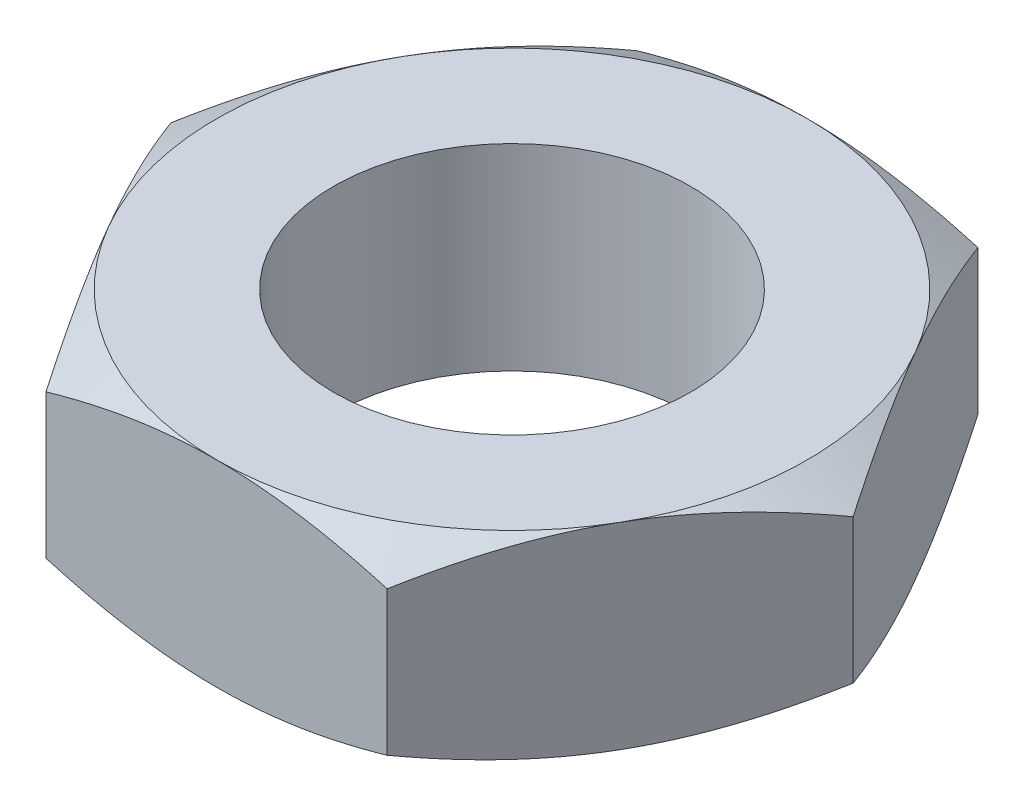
ISO-10303-21;
HEADER;
FILE_DESCRIPTION(('STEP AP214'),'2;1');
FILE_NAME('part.step','',(''),(''),'','','');
FILE_SCHEMA(('AUTOMOTIVE_DESIGN { 1 0 10303 214 1 1 1 1 }'));
ENDSEC;
DATA;
#1=APPLICATION_CONTEXT('core data for automotive mechanical design processes');
#2=APPLICATION_PROTOCOL_DEFINITION('international standard','automotive_design',2000,#1);
#3=PRODUCT_CONTEXT('',#1,'mechanical');
#4=PRODUCT('Part','Part','',(#3));
#5=PRODUCT_RELATED_PRODUCT_CATEGORY('part','',(#4));
#6=PRODUCT_DEFINITION_FORMATION('','',#4);
#7=PRODUCT_DEFINITION_CONTEXT('part definition',#1,'design');
#8=PRODUCT_DEFINITION('design','',#6,#7);
#9=PRODUCT_DEFINITION_SHAPE('','',#8);
#10=(LENGTH_UNIT() NAMED_UNIT(*) SI_UNIT(.MILLI.,.METRE.));
#11=(NAMED_UNIT(*) PLANE_ANGLE_UNIT() SI_UNIT($,.RADIAN.));
#12=(NAMED_UNIT(*) SI_UNIT($,.STERADIAN.) SOLID_ANGLE_UNIT());
#13=UNCERTAINTY_MEASURE_WITH_UNIT(LENGTH_MEASURE(1.E-05),#10,'distance_accuracy_value','');
#14=(GEOMETRIC_REPRESENTATION_CONTEXT(3) GLOBAL_UNCERTAINTY_ASSIGNED_CONTEXT((#13)) GLOBAL_UNIT_ASSIGNED_CONTEXT((#10,
#11,#12)) REPRESENTATION_CONTEXT('',''));
#15=CARTESIAN_POINT('',(0.,0.,0.));
#16=DIRECTION('',(0.,0.,1.));
#17=DIRECTION('',(1.,0.,0.));
#18=AXIS2_PLACEMENT_3D('',#15,#16,#17);
#19=CARTESIAN_POINT('',(-6.92820323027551,8.,12.));
#20=DIRECTION('',(0.,0.,-1.));
#21=DIRECTION('',(-1.,0.,0.));
#22=AXIS2_PLACEMENT_3D('',#19,#20,#21);
#23=PLANE('',#22);
#24=CARTESIAN_POINT('',(-18.6434122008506,5.8725365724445,12.));
#25=CARTESIAN_POINT('',(-18.3812273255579,5.74525423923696,12.));
#26=CARTESIAN_POINT('',(-18.1187356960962,5.61860407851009,12.));
#27=CARTESIAN_POINT('',(-17.5930749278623,5.36671120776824,12.));
#28=CARTESIAN_POINT('',(-17.329905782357,5.24146851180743,12.));
#29=CARTESIAN_POINT('',(-16.5392164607,4.86803349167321,12.));
#30=CARTESIAN_POINT('',(-16.0105914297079,4.62217173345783,12.));
#31=CARTESIAN_POINT('',(-14.9469541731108,4.13682677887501,12.));
#32=CARTESIAN_POINT('',(-14.4119228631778,3.89738530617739,12.));
#33=CARTESIAN_POINT('',(-13.3376171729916,3.42825229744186,12.));
#34=CARTESIAN_POINT('',(-12.7983429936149,3.19856030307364,12.));
#35=CARTESIAN_POINT('',(-11.6971343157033,2.74426091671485,12.));
#36=CARTESIAN_POINT('',(-11.1350315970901,2.52005916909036,12.));
#37=CARTESIAN_POINT('',(-10.0042582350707,2.08854249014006,12.));
#38=CARTESIAN_POINT('',(-9.43558686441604,1.88122944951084,12.));
#39=CARTESIAN_POINT('',(-8.29184369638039,1.48891137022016,12.));
#40=CARTESIAN_POINT('',(-7.71678741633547,1.30386145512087,12.));
#41=CARTESIAN_POINT('',(-6.55837133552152,0.961975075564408,12.));
#42=CARTESIAN_POINT('',(-5.9750142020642,0.805129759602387,12.));
#43=CARTESIAN_POINT('',(-5.09526966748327,0.597105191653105,12.));
#44=CARTESIAN_POINT('',(-4.80205079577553,0.532445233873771,12.));
#45=CARTESIAN_POINT('',(-4.21360328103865,0.412972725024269,12.));
#46=CARTESIAN_POINT('',(-3.91837467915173,0.358159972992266,12.));
#47=CARTESIAN_POINT('',(-3.32610862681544,0.259347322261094,12.));
#48=CARTESIAN_POINT('',(-3.02907120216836,0.215347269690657,12.));
#49=CARTESIAN_POINT('',(-2.43349976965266,0.139036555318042,12.));
#50=CARTESIAN_POINT('',(-2.13496582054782,0.10672543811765,12.));
#51=CARTESIAN_POINT('',(-1.54073050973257,0.0548414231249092,12.));
#52=CARTESIAN_POINT('',(-1.24504333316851,0.0351070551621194,12.));
#53=CARTESIAN_POINT('',(-0.653099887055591,0.00816211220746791,12.));
#54=CARTESIAN_POINT('',(-0.356843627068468,0.00095132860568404,12.));
#55=CARTESIAN_POINT('',(0.235708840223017,-0.000774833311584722,12.));
#56=CARTESIAN_POINT('',(0.532005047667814,0.00470983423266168,12.));
#57=CARTESIAN_POINT('',(1.12410170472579,0.0282404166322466,12.));
#58=CARTESIAN_POINT('',(1.41990213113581,0.046286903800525,12.));
#59=CARTESIAN_POINT('',(2.12980105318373,0.104287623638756,12.));
#60=CARTESIAN_POINT('',(2.54342568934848,0.15014631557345,12.));
#61=CARTESIAN_POINT('',(3.36762955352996,0.263936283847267,12.));
#62=CARTESIAN_POINT('',(3.7782083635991,0.331870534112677,12.));
#63=CARTESIAN_POINT('',(4.59592121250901,0.487395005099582,12.));
#64=CARTESIAN_POINT('',(5.00305232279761,0.575000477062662,12.));
#65=CARTESIAN_POINT('',(5.81324231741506,0.767192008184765,12.));
#66=CARTESIAN_POINT('',(6.21630126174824,0.871777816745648,12.));
#67=CARTESIAN_POINT('',(7.02721090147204,1.09785494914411,12.));
#68=CARTESIAN_POINT('',(7.43497120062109,1.21966827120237,12.));
#69=CARTESIAN_POINT('',(8.24647542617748,1.47594194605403,12.));
#70=CARTESIAN_POINT('',(8.65021932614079,1.61040238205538,12.));
#71=CARTESIAN_POINT('',(9.4538890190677,1.88983002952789,12.));
#72=CARTESIAN_POINT('',(9.85381602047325,2.03479378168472,12.));
#73=CARTESIAN_POINT('',(10.6503522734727,2.33351665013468,12.));
#74=CARTESIAN_POINT('',(11.0469615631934,2.48727566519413,12.));
#75=CARTESIAN_POINT('',(11.9796831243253,2.85888391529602,12.));
#76=CARTESIAN_POINT('',(12.514548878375,3.0798570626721,12.));
#77=CARTESIAN_POINT('',(13.5797439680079,3.53251041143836,12.));
#78=CARTESIAN_POINT('',(14.1100730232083,3.76419126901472,12.));
#79=CARTESIAN_POINT('',(15.1670347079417,4.2361253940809,12.));
#80=CARTESIAN_POINT('',(15.693666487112,4.47638056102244,12.));
#81=CARTESIAN_POINT('',(16.7437293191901,4.96374095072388,12.));
#82=CARTESIAN_POINT('',(17.2671604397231,5.21084602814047,12.));
#83=CARTESIAN_POINT('',(18.311920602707,5.7109032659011,12.));
#84=CARTESIAN_POINT('',(18.8332467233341,5.96386152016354,12.));
#85=CARTESIAN_POINT('',(19.8736465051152,6.47436761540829,12.));
#86=CARTESIAN_POINT('',(20.3927201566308,6.73191547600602,12.));
#87=CARTESIAN_POINT('',(21.4288931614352,7.25078329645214,12.));
#88=CARTESIAN_POINT('',(21.9459927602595,7.5121027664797,12.));
#89=CARTESIAN_POINT('',(22.9785686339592,8.03793120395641,12.));
#90=CARTESIAN_POINT('',(23.4940449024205,8.30244018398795,12.));
#91=CARTESIAN_POINT('',(24.9524027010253,9.05557837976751,12.));
#92=CARTESIAN_POINT('',(25.8936507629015,9.54737055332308,12.));
#93=CARTESIAN_POINT('',(27.7726304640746,10.5376909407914,12.));
#94=CARTESIAN_POINT('',(28.710361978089,11.0362193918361,12.));
#95=CARTESIAN_POINT('',(30.5807300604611,12.0371886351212,12.));
#96=CARTESIAN_POINT('',(31.513373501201,12.5396165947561,12.));
#97=CARTESIAN_POINT('',(32.9106782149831,13.2962602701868,12.));
#98=CARTESIAN_POINT('',(33.3761571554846,13.5489682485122,12.));
#99=CARTESIAN_POINT('',(34.3066240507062,14.0552848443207,12.));
#100=CARTESIAN_POINT('',(34.7716120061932,14.3088934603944,12.));
#101=CARTESIAN_POINT('',(35.236382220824,14.5629006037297,12.));
#102=B_SPLINE_CURVE_WITH_KNOTS('',3,(#24,#25,#26,#27,#28,#29,#30,#31,#32,#33,#34,#35,#36,#37,
#38,#39,#40,#41,#42,#43,#44,#45,#46,#47,#48,#49,#50,#51,#52,#53,#54,#55,#56,#57,#58,#59,#60,#61,
#62,#63,#64,#65,#66,#67,#68,#69,#70,#71,#72,#73,#74,#75,#76,#77,#78,#79,#80,#81,#82,#83,#84,#85,
#86,#87,#88,#89,#90,#91,#92,#93,#94,#95,#96,#97,#98,#99,#100,#101),.UNSPECIFIED.,.F.,.F.,(4,2,2,
2,2,2,2,2,2,2,2,2,2,2,2,2,2,2,2,2,2,2,2,2,2,2,2,2,2,2,2,2,2,2,2,2,2,2,4),(0.,0.874341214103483,
1.74869115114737,3.4976480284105,5.25607058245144,7.01441037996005,8.8297011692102,
10.6451949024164,12.4569654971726,14.2681665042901,15.1688186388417,16.0694523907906,
16.9700733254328,17.8706591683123,18.7594363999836,19.6481988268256,20.5369644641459,
21.4257705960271,22.6735580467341,23.9215136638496,25.170440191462,26.4193482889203,
27.6958030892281,28.9722662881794,30.2483109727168,31.524340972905,33.2603266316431,
34.9964188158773,36.7328980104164,38.4693403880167,40.2076801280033,41.9460272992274,
43.6841507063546,45.4222809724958,48.6081880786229,51.7942076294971,54.972294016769,
56.5612513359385,58.1502061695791),.UNSPECIFIED.);
#103=CARTESIAN_POINT('',(6.92820323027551,1.07179676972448,12.));
#104=VERTEX_POINT('',#103);
#105=CARTESIAN_POINT('',(0.,0.,12.));
#106=VERTEX_POINT('',#105);
#107=EDGE_CURVE('E127',#104,#106,#102,.F.);
#108=ORIENTED_EDGE('',*,*,#107,.F.);
#109=DIRECTION('',(0.,-1.,0.));
#110=VECTOR('',#109,1.);
#111=CARTESIAN_POINT('',(6.92820323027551,8.,12.));
#112=LINE('',#111,#110);
#113=CARTESIAN_POINT('',(6.92820323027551,6.92820323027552,12.));
#114=VERTEX_POINT('',#113);
#115=EDGE_CURVE('E261',#114,#104,#112,.T.);
#116=ORIENTED_EDGE('',*,*,#115,.F.);
#117=CARTESIAN_POINT('',(-18.6434122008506,2.1274634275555,12.));
#118=CARTESIAN_POINT('',(-18.3812273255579,2.25474576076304,12.));
#119=CARTESIAN_POINT('',(-18.1187356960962,2.38139592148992,12.));
#120=CARTESIAN_POINT('',(-17.5930749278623,2.63328879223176,12.));
#121=CARTESIAN_POINT('',(-17.329905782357,2.75853148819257,12.));
#122=CARTESIAN_POINT('',(-16.5392164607,3.13196650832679,12.));
#123=CARTESIAN_POINT('',(-16.0105914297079,3.37782826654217,12.));
#124=CARTESIAN_POINT('',(-14.9469541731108,3.86317322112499,12.));
#125=CARTESIAN_POINT('',(-14.4119228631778,4.10261469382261,12.));
#126=CARTESIAN_POINT('',(-13.3376171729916,4.57174770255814,12.));
#127=CARTESIAN_POINT('',(-12.7983429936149,4.80143969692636,12.));
#128=CARTESIAN_POINT('',(-11.6971343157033,5.25573908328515,12.));
#129=CARTESIAN_POINT('',(-11.1350315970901,5.47994083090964,12.));
#130=CARTESIAN_POINT('',(-10.0042582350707,5.91145750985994,12.));
#131=CARTESIAN_POINT('',(-9.43558686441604,6.11877055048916,12.));
#132=CARTESIAN_POINT('',(-8.29184369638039,6.51108862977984,12.));
#133=CARTESIAN_POINT('',(-7.71678741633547,6.69613854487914,12.));
#134=CARTESIAN_POINT('',(-6.55837133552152,7.03802492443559,12.));
#135=CARTESIAN_POINT('',(-5.9750142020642,7.19487024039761,12.));
#136=CARTESIAN_POINT('',(-5.09526966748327,7.4028948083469,12.));
#137=CARTESIAN_POINT('',(-4.80205079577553,7.46755476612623,12.));
#138=CARTESIAN_POINT('',(-4.21360328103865,7.58702727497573,12.));
#139=CARTESIAN_POINT('',(-3.91837467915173,7.64184002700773,12.));
#140=CARTESIAN_POINT('',(-3.32610862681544,7.74065267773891,12.));
#141=CARTESIAN_POINT('',(-3.02907120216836,7.78465273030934,12.));
#142=CARTESIAN_POINT('',(-2.43349976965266,7.86096344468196,12.));
#143=CARTESIAN_POINT('',(-2.13496582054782,7.89327456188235,12.));
#144=CARTESIAN_POINT('',(-1.54073050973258,7.94515857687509,12.));
#145=CARTESIAN_POINT('',(-1.24504333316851,7.96489294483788,12.));
#146=CARTESIAN_POINT('',(-0.653099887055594,7.99183788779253,12.));
#147=CARTESIAN_POINT('',(-0.356843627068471,7.99904867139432,12.));
#148=CARTESIAN_POINT('',(0.235708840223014,8.00077483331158,12.));
#149=CARTESIAN_POINT('',(0.532005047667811,7.99529016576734,12.));
#150=CARTESIAN_POINT('',(1.12410170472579,7.97175958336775,12.));
#151=CARTESIAN_POINT('',(1.41990213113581,7.95371309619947,12.));
#152=CARTESIAN_POINT('',(2.12980105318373,7.89571237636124,12.));
#153=CARTESIAN_POINT('',(2.54342568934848,7.84985368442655,12.));
#154=CARTESIAN_POINT('',(3.36762955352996,7.73606371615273,12.));
#155=CARTESIAN_POINT('',(3.7782083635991,7.66812946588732,12.));
#156=CARTESIAN_POINT('',(4.595921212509,7.51260499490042,12.));
#157=CARTESIAN_POINT('',(5.00305232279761,7.42499952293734,12.));
#158=CARTESIAN_POINT('',(5.81324231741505,7.23280799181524,12.));
#159=CARTESIAN_POINT('',(6.21630126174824,7.12822218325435,12.));
#160=CARTESIAN_POINT('',(7.02721090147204,6.90214505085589,12.));
#161=CARTESIAN_POINT('',(7.43497120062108,6.78033172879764,12.));
#162=CARTESIAN_POINT('',(8.24647542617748,6.52405805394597,12.));
#163=CARTESIAN_POINT('',(8.65021932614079,6.38959761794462,12.));
#164=CARTESIAN_POINT('',(9.45388901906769,6.11016997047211,12.));
#165=CARTESIAN_POINT('',(9.85381602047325,5.96520621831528,12.));
#166=CARTESIAN_POINT('',(10.6503522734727,5.66648334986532,12.));
#167=CARTESIAN_POINT('',(11.0469615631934,5.51272433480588,12.));
#168=CARTESIAN_POINT('',(11.9796831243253,5.14111608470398,12.));
#169=CARTESIAN_POINT('',(12.514548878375,4.92014293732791,12.));
#170=CARTESIAN_POINT('',(13.5797439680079,4.46748958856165,12.));
#171=CARTESIAN_POINT('',(14.1100730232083,4.23580873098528,12.));
#172=CARTESIAN_POINT('',(15.1670347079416,3.7638746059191,12.));
#173=CARTESIAN_POINT('',(15.693666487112,3.52361943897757,12.));
#174=CARTESIAN_POINT('',(16.7437293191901,3.03625904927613,12.));
#175=CARTESIAN_POINT('',(17.2671604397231,2.78915397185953,12.));
#176=CARTESIAN_POINT('',(18.311920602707,2.2890967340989,12.));
#177=CARTESIAN_POINT('',(18.833246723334,2.03613847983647,12.));
#178=CARTESIAN_POINT('',(19.8736465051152,1.52563238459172,12.));
#179=CARTESIAN_POINT('',(20.3927201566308,1.26808452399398,12.));
#180=CARTESIAN_POINT('',(21.4288931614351,0.749216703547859,12.));
#181=CARTESIAN_POINT('',(21.9459927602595,0.487897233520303,12.));
#182=CARTESIAN_POINT('',(22.9785686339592,-0.0379312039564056,12.));
#183=CARTESIAN_POINT('',(23.4940449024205,-0.302440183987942,12.));
#184=CARTESIAN_POINT('',(24.9524027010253,-1.05557837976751,12.));
#185=CARTESIAN_POINT('',(25.8936507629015,-1.54737055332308,12.));
#186=CARTESIAN_POINT('',(27.7726304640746,-2.53769094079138,12.));
#187=CARTESIAN_POINT('',(28.710361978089,-3.03621939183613,12.));
#188=CARTESIAN_POINT('',(30.5807300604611,-4.03718863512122,12.));
#189=CARTESIAN_POINT('',(31.513373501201,-4.53961659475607,12.));
#190=CARTESIAN_POINT('',(32.9106782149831,-5.29626027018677,12.));
#191=CARTESIAN_POINT('',(33.3761571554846,-5.54896824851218,12.));
#192=CARTESIAN_POINT('',(34.3066240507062,-6.0552848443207,12.));
#193=CARTESIAN_POINT('',(34.7716120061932,-6.30889346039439,12.));
#194=CARTESIAN_POINT('',(35.236382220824,-6.56290060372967,12.));
#195=B_SPLINE_CURVE_WITH_KNOTS('',3,(#117,#118,#119,#120,#121,#122,#123,#124,#125,#126,#127,
#128,#129,#130,#131,#132,#133,#134,#135,#136,#137,#138,#139,#140,#141,#142,#143,#144,#145,#146,
#147,#148,#149,#150,#151,#152,#153,#154,#155,#156,#157,#158,#159,#160,#161,#162,#163,#164,#165,
#166,#167,#168,#169,#170,#171,#172,#173,#174,#175,#176,#177,#178,#179,#180,#181,#182,#183,#184,
#185,#186,#187,#188,#189,#190,#191,#192,#193,#194),.UNSPECIFIED.,.F.,.F.,(4,2,2,2,2,2,2,2,2,2,2,
2,2,2,2,2,2,2,2,2,2,2,2,2,2,2,2,2,2,2,2,2,2,2,2,2,2,2,4),(0.,0.874341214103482,1.74869115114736,
3.4976480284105,5.25607058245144,7.01441037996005,8.8297011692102,10.6451949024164,
12.4569654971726,14.2681665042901,15.1688186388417,16.0694523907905,16.9700733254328,
17.8706591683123,18.7594363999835,19.6481988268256,20.5369644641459,21.425770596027,
22.6735580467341,23.9215136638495,25.170440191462,26.4193482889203,27.6958030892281,
28.9722662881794,30.2483109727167,31.524340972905,33.2603266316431,34.9964188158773,
36.7328980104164,38.4693403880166,40.2076801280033,41.9460272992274,43.6841507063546,
45.4222809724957,48.6081880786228,51.7942076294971,54.972294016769,56.5612513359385,
58.1502061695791),.UNSPECIFIED.);
#196=CARTESIAN_POINT('',(0.,8.,12.));
#197=VERTEX_POINT('',#196);
#198=EDGE_CURVE('E237',#197,#114,#195,.T.);
#199=ORIENTED_EDGE('',*,*,#198,.F.);
#200=CARTESIAN_POINT('',(-6.92820323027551,6.92820323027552,12.));
#201=VERTEX_POINT('',#200);
#202=EDGE_CURVE('E243',#201,#197,#195,.T.);
#203=ORIENTED_EDGE('',*,*,#202,.F.);
#204=DIRECTION('',(0.,-1.,0.));
#205=VECTOR('',#204,1.);
#206=CARTESIAN_POINT('',(-6.92820323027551,8.,12.));
#207=LINE('',#206,#205);
#208=CARTESIAN_POINT('',(-6.92820323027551,1.07179676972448,12.));
#209=VERTEX_POINT('',#208);
#210=EDGE_CURVE('E158',#201,#209,#207,.T.);
#211=ORIENTED_EDGE('',*,*,#210,.T.);
#212=EDGE_CURVE('E140',#106,#209,#102,.F.);
#213=ORIENTED_EDGE('',*,*,#212,.F.);
#214=EDGE_LOOP('',(#108,#116,#199,#203,#211,#213));
#215=FACE_BOUND('',#214,.T.);
#216=ADVANCED_FACE('F37',(#215),#23,.F.);
#217=CARTESIAN_POINT('',(6.92820323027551,8.,12.));
#218=DIRECTION('',(-0.866025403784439,0.,-0.5));
#219=DIRECTION('',(-0.5,0.,0.866025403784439));
#220=AXIS2_PLACEMENT_3D('',#217,#218,#219);
#221=PLANE('',#220);
#222=CARTESIAN_POINT('',(13.8565219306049,1.07186343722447,-0.000200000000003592));
#223=CARTESIAN_POINT('',(13.7042251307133,0.983949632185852,0.263585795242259));
#224=CARTESIAN_POINT('',(13.5513604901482,0.900025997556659,0.528355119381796));
#225=CARTESIAN_POINT('',(13.244405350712,0.741266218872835,1.06001701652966));
#226=CARTESIAN_POINT('',(13.0903144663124,0.666433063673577,1.32691025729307));
#227=CARTESIAN_POINT('',(12.6255589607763,0.457017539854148,2.13189040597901));
#228=CARTESIAN_POINT('',(12.3130596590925,0.337903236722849,2.6731550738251));
#229=CARTESIAN_POINT('',(11.8454187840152,0.198231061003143,3.48313282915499));
#230=CARTESIAN_POINT('',(11.6916742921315,0.158443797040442,3.74942610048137));
#231=CARTESIAN_POINT('',(11.3834734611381,0.091723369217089,4.28324559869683));
#232=CARTESIAN_POINT('',(11.2290171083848,0.0647904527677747,4.55077184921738));
#233=CARTESIAN_POINT('',(10.9198468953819,0.0244685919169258,5.08627036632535));
#234=CARTESIAN_POINT('',(10.7651335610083,0.0110635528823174,5.35424172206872));
#235=CARTESIAN_POINT('',(10.4555635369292,-0.00191690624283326,5.89043273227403));
#236=CARTESIAN_POINT('',(10.3007068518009,-0.00149275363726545,6.15865237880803));
#237=CARTESIAN_POINT('',(10.0112020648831,0.0122200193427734,6.6600893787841));
#238=CARTESIAN_POINT('',(9.87653331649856,0.0238359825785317,6.89334249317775));
#239=CARTESIAN_POINT('',(9.60750555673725,0.0573080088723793,7.35931224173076));
#240=CARTESIAN_POINT('',(9.47314656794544,0.0791647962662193,7.59202883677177));
#241=CARTESIAN_POINT('',(9.2048113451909,0.132737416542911,8.05679907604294));
#242=CARTESIAN_POINT('',(9.07083551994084,0.164461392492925,8.288852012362));
#243=CARTESIAN_POINT('',(8.80351197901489,0.237211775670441,8.75186996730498));
#244=CARTESIAN_POINT('',(8.67016430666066,0.278238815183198,8.98283491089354));
#245=CARTESIAN_POINT('',(8.2653799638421,0.416311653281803,9.68394195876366));
#246=CARTESIAN_POINT('',(7.99511549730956,0.527124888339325,10.1520537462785));
#247=CARTESIAN_POINT('',(7.45861659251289,0.77862576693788,11.0812971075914));
#248=CARTESIAN_POINT('',(7.19237528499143,0.919254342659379,11.5424405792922));
#249=CARTESIAN_POINT('',(6.92808776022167,1.07186343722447,12.0002));
#250=B_SPLINE_CURVE_WITH_KNOTS('',3,(#222,#223,#224,#225,#226,#227,#228,#229,#230,#231,#232,
#233,#234,#235,#236,#237,#238,#239,#240,#241,#242,#243,#244,#245,#246,#247,#248,#249),
.UNSPECIFIED.,.F.,.F.,(4,2,2,2,2,2,2,2,2,2,2,2,2,4),(0.,0.951004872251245,1.90232158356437,
3.80900466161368,4.7389455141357,5.66890426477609,6.59775529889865,7.5265776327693,
8.33514643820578,9.14377244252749,9.95306755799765,10.7624176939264,12.4167102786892,
14.0677556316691),.UNSPECIFIED.);
#251=CARTESIAN_POINT('',(13.856406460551,1.07179676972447,0.));
#252=VERTEX_POINT('',#251);
#253=CARTESIAN_POINT('',(10.3923048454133,0.,5.99999999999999));
#254=VERTEX_POINT('',#253);
#255=EDGE_CURVE('E54',#252,#254,#250,.T.);
#256=ORIENTED_EDGE('',*,*,#255,.F.);
#257=DIRECTION('',(0.,-1.,0.));
#258=VECTOR('',#257,1.);
#259=CARTESIAN_POINT('',(13.856406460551,8.,0.));
#260=LINE('',#259,#258);
#261=CARTESIAN_POINT('',(13.856406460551,6.92820323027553,0.));
#262=VERTEX_POINT('',#261);
#263=EDGE_CURVE('E257',#262,#252,#260,.T.);
#264=ORIENTED_EDGE('',*,*,#263,.F.);
#265=CARTESIAN_POINT('',(6.92808776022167,6.92813656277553,12.0002));
#266=CARTESIAN_POINT('',(7.08038456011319,7.01605036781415,11.7364142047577));
#267=CARTESIAN_POINT('',(7.23324920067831,7.09997400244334,11.4716448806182));
#268=CARTESIAN_POINT('',(7.54020434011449,7.25873378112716,10.9399829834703));
#269=CARTESIAN_POINT('',(7.69429522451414,7.33356693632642,10.6730897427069));
#270=CARTESIAN_POINT('',(8.15905073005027,7.54298246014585,9.86810959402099));
#271=CARTESIAN_POINT('',(8.47155003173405,7.66209676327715,9.3268449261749));
#272=CARTESIAN_POINT('',(8.93919090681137,7.80176893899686,8.516867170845));
#273=CARTESIAN_POINT('',(9.09293539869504,7.84155620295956,8.25057389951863));
#274=CARTESIAN_POINT('',(9.40113622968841,7.90827663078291,7.71675440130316));
#275=CARTESIAN_POINT('',(9.55559258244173,7.93520954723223,7.44922815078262));
#276=CARTESIAN_POINT('',(9.86476279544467,7.97553140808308,6.91372963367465));
#277=CARTESIAN_POINT('',(10.0194761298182,7.98893644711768,6.64575827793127));
#278=CARTESIAN_POINT('',(10.3290461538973,8.00191690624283,6.10956726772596));
#279=CARTESIAN_POINT('',(10.4839028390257,8.00149275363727,5.84134762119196));
#280=CARTESIAN_POINT('',(10.7734076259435,7.98777998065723,5.33991062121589));
#281=CARTESIAN_POINT('',(10.908076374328,7.97616401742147,5.10665750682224));
#282=CARTESIAN_POINT('',(11.1771041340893,7.94269199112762,4.64068775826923));
#283=CARTESIAN_POINT('',(11.3114631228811,7.92083520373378,4.40797116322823));
#284=CARTESIAN_POINT('',(11.5797983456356,7.86726258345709,3.94320092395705));
#285=CARTESIAN_POINT('',(11.7137741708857,7.83553860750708,3.71114798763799));
#286=CARTESIAN_POINT('',(11.9810977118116,7.76278822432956,3.24813003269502));
#287=CARTESIAN_POINT('',(12.1144453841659,7.7217611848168,3.01716508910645));
#288=CARTESIAN_POINT('',(12.5192297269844,7.5836883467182,2.31605804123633));
#289=CARTESIAN_POINT('',(12.789494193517,7.47287511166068,1.84794625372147));
#290=CARTESIAN_POINT('',(13.3259930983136,7.22137423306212,0.918702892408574));
#291=CARTESIAN_POINT('',(13.5922344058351,7.08074565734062,0.457559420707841));
#292=CARTESIAN_POINT('',(13.8565219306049,6.92813656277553,-0.00020000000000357));
#293=B_SPLINE_CURVE_WITH_KNOTS('',3,(#265,#266,#267,#268,#269,#270,#271,#272,#273,#274,#275,
#276,#277,#278,#279,#280,#281,#282,#283,#284,#285,#286,#287,#288,#289,#290,#291,#292),
.UNSPECIFIED.,.F.,.F.,(4,2,2,2,2,2,2,2,2,2,2,2,2,4),(0.,0.951004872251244,1.90232158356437,
3.80900466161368,4.7389455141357,5.66890426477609,6.59775529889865,7.5265776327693,
8.33514643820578,9.14377244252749,9.95306755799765,10.7624176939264,12.4167102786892,
14.0677556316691),.UNSPECIFIED.);
#294=CARTESIAN_POINT('',(10.3923048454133,8.,5.99999999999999));
#295=VERTEX_POINT('',#294);
#296=EDGE_CURVE('E223',#295,#262,#293,.T.);
#297=ORIENTED_EDGE('',*,*,#296,.F.);
#298=EDGE_CURVE('E230',#114,#295,#293,.T.);
#299=ORIENTED_EDGE('',*,*,#298,.F.);
#300=ORIENTED_EDGE('',*,*,#115,.T.);
#301=EDGE_CURVE('E133',#254,#104,#250,.T.);
#302=ORIENTED_EDGE('',*,*,#301,.F.);
#303=EDGE_LOOP('',(#256,#264,#297,#299,#300,#302));
#304=FACE_BOUND('',#303,.T.);
#305=ADVANCED_FACE('F215',(#304),#221,.F.);
#306=CARTESIAN_POINT('',(13.856406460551,8.,0.));
#307=DIRECTION('',(-0.866025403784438,0.,0.5));
#308=DIRECTION('',(0.5,0.,0.866025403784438));
#309=AXIS2_PLACEMENT_3D('',#306,#307,#308);
#310=PLANE('',#309);
#311=CARTESIAN_POINT('',(6.92808776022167,1.07186343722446,-12.0002));
#312=CARTESIAN_POINT('',(7.08038456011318,0.98394963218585,-11.7364142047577));
#313=CARTESIAN_POINT('',(7.2332492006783,0.900025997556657,-11.4716448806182));
#314=CARTESIAN_POINT('',(7.54020434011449,0.741266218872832,-10.9399829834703));
#315=CARTESIAN_POINT('',(7.69429522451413,0.666433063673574,-10.6730897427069));
#316=CARTESIAN_POINT('',(8.15905073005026,0.457017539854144,-9.86810959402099));
#317=CARTESIAN_POINT('',(8.47155003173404,0.337903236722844,-9.32684492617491));
#318=CARTESIAN_POINT('',(8.93919090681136,0.19823106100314,-8.51686717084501));
#319=CARTESIAN_POINT('',(9.09293539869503,0.158443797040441,-8.25057389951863));
#320=CARTESIAN_POINT('',(9.4011362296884,0.0917233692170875,-7.71675440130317));
#321=CARTESIAN_POINT('',(9.55559258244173,0.064790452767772,-7.44922815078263));
#322=CARTESIAN_POINT('',(9.86476279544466,0.0244685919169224,-6.91372963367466));
#323=CARTESIAN_POINT('',(10.0194761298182,0.0110635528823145,-6.64575827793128));
#324=CARTESIAN_POINT('',(10.3290461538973,-0.00191690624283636,-6.10956726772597));
#325=CARTESIAN_POINT('',(10.4839028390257,-0.00149275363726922,-5.84134762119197));
#326=CARTESIAN_POINT('',(10.7734076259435,0.0122200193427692,-5.33991062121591));
#327=CARTESIAN_POINT('',(10.908076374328,0.0238359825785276,-5.10665750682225));
#328=CARTESIAN_POINT('',(11.1771041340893,0.0573080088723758,-4.64068775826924));
#329=CARTESIAN_POINT('',(11.3114631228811,0.0791647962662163,-4.40797116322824));
#330=CARTESIAN_POINT('',(11.5797983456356,0.132737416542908,-3.94320092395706));
#331=CARTESIAN_POINT('',(11.7137741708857,0.164461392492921,-3.711147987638));
#332=CARTESIAN_POINT('',(11.9810977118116,0.237211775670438,-3.24813003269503));
#333=CARTESIAN_POINT('',(12.1144453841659,0.278238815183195,-3.01716508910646));
#334=CARTESIAN_POINT('',(12.5192297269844,0.416311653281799,-2.31605804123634));
#335=CARTESIAN_POINT('',(12.789494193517,0.527124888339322,-1.84794625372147));
#336=CARTESIAN_POINT('',(13.3259930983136,0.778625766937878,-0.91870289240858));
#337=CARTESIAN_POINT('',(13.5922344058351,0.919254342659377,-0.457559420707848));
#338=CARTESIAN_POINT('',(13.8565219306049,1.07186343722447,0.000199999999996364));
#339=B_SPLINE_CURVE_WITH_KNOTS('',3,(#311,#312,#313,#314,#315,#316,#317,#318,#319,#320,#321,
#322,#323,#324,#325,#326,#327,#328,#329,#330,#331,#332,#333,#334,#335,#336,#337,#338),
.UNSPECIFIED.,.F.,.F.,(4,2,2,2,2,2,2,2,2,2,2,2,2,4),(0.,0.951004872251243,1.90232158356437,
3.80900466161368,4.73894551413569,5.66890426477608,6.59775529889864,7.52657763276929,
8.33514643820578,9.14377244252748,9.95306755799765,10.7624176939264,12.4167102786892,
14.0677556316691),.UNSPECIFIED.);
#340=CARTESIAN_POINT('',(6.9282032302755,1.07179676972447,-12.));
#341=VERTEX_POINT('',#340);
#342=CARTESIAN_POINT('',(10.3923048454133,0.,-6.00000000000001));
#343=VERTEX_POINT('',#342);
#344=EDGE_CURVE('E61',#341,#343,#339,.T.);
#345=ORIENTED_EDGE('',*,*,#344,.F.);
#346=DIRECTION('',(0.,-1.,0.));
#347=VECTOR('',#346,1.);
#348=CARTESIAN_POINT('',(6.9282032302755,8.,-12.));
#349=LINE('',#348,#347);
#350=CARTESIAN_POINT('',(6.9282032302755,6.92820323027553,-12.));
#351=VERTEX_POINT('',#350);
#352=EDGE_CURVE('E253',#351,#341,#349,.T.);
#353=ORIENTED_EDGE('',*,*,#352,.F.);
#354=CARTESIAN_POINT('',(13.8565219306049,6.92813656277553,0.000199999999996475));
#355=CARTESIAN_POINT('',(13.7042251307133,7.01605036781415,-0.263585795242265));
#356=CARTESIAN_POINT('',(13.5513604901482,7.09997400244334,-0.528355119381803));
#357=CARTESIAN_POINT('',(13.244405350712,7.25873378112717,-1.06001701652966));
#358=CARTESIAN_POINT('',(13.0903144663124,7.33356693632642,-1.32691025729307));
#359=CARTESIAN_POINT('',(12.6255589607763,7.54298246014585,-2.13189040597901));
#360=CARTESIAN_POINT('',(12.3130596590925,7.66209676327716,-2.6731550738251));
#361=CARTESIAN_POINT('',(11.8454187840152,7.80176893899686,-3.483132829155));
#362=CARTESIAN_POINT('',(11.6916742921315,7.84155620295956,-3.74942610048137));
#363=CARTESIAN_POINT('',(11.3834734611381,7.90827663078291,-4.28324559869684));
#364=CARTESIAN_POINT('',(11.2290171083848,7.93520954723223,-4.55077184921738));
#365=CARTESIAN_POINT('',(10.9198468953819,7.97553140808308,-5.08627036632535));
#366=CARTESIAN_POINT('',(10.7651335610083,7.98893644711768,-5.35424172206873));
#367=CARTESIAN_POINT('',(10.4555635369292,8.00191690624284,-5.89043273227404));
#368=CARTESIAN_POINT('',(10.3007068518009,8.00149275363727,-6.15865237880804));
#369=CARTESIAN_POINT('',(10.011202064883,7.98777998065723,-6.6600893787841));
#370=CARTESIAN_POINT('',(9.87653331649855,7.97616401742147,-6.89334249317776));
#371=CARTESIAN_POINT('',(9.60750555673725,7.94269199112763,-7.35931224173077));
#372=CARTESIAN_POINT('',(9.47314656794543,7.92083520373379,-7.59202883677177));
#373=CARTESIAN_POINT('',(9.20481134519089,7.86726258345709,-8.05679907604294));
#374=CARTESIAN_POINT('',(9.07083551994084,7.83553860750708,-8.288852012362));
#375=CARTESIAN_POINT('',(8.80351197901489,7.76278822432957,-8.75186996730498));
#376=CARTESIAN_POINT('',(8.67016430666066,7.72176118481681,-8.98283491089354));
#377=CARTESIAN_POINT('',(8.2653799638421,7.5836883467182,-9.68394195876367));
#378=CARTESIAN_POINT('',(7.99511549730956,7.47287511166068,-10.1520537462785));
#379=CARTESIAN_POINT('',(7.45861659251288,7.22137423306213,-11.0812971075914));
#380=CARTESIAN_POINT('',(7.19237528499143,7.08074565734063,-11.5424405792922));
#381=CARTESIAN_POINT('',(6.92808776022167,6.92813656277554,-12.0002));
#382=B_SPLINE_CURVE_WITH_KNOTS('',3,(#354,#355,#356,#357,#358,#359,#360,#361,#362,#363,#364,
#365,#366,#367,#368,#369,#370,#371,#372,#373,#374,#375,#376,#377,#378,#379,#380,#381),
.UNSPECIFIED.,.F.,.F.,(4,2,2,2,2,2,2,2,2,2,2,2,2,4),(0.,0.951004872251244,1.90232158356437,
3.80900466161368,4.7389455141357,5.66890426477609,6.59775529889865,7.52657763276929,
8.33514643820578,9.14377244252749,9.95306755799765,10.7624176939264,12.4167102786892,
14.0677556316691),.UNSPECIFIED.);
#383=CARTESIAN_POINT('',(10.3923048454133,8.,-6.00000000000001));
#384=VERTEX_POINT('',#383);
#385=EDGE_CURVE('E232',#384,#351,#382,.T.);
#386=ORIENTED_EDGE('',*,*,#385,.F.);
#387=EDGE_CURVE('E231',#262,#384,#382,.T.);
#388=ORIENTED_EDGE('',*,*,#387,.F.);
#389=ORIENTED_EDGE('',*,*,#263,.T.);
#390=EDGE_CURVE('E209',#343,#252,#339,.T.);
#391=ORIENTED_EDGE('',*,*,#390,.F.);
#392=EDGE_LOOP('',(#345,#353,#386,#388,#389,#391));
#393=FACE_BOUND('',#392,.T.);
#394=ADVANCED_FACE('F218',(#393),#310,.F.);
#395=CARTESIAN_POINT('',(6.9282032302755,8.,-12.));
#396=DIRECTION('',(0.,0.,1.));
#397=DIRECTION('',(1.,0.,0.));
#398=AXIS2_PLACEMENT_3D('',#395,#396,#397);
#399=PLANE('',#398);
#400=CARTESIAN_POINT('',(-18.6434122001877,5.87253657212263,-12.));
#401=CARTESIAN_POINT('',(-18.3812273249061,5.74525423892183,-12.));
#402=CARTESIAN_POINT('',(-18.1187356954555,5.61860407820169,-12.));
#403=CARTESIAN_POINT('',(-17.5930749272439,5.36671120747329,-12.));
#404=CARTESIAN_POINT('',(-17.3299057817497,5.24146851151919,-12.));
#405=CARTESIAN_POINT('',(-16.5392164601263,4.8680334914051,-12.));
#406=CARTESIAN_POINT('',(-16.0105914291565,4.62217173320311,-12.));
#407=CARTESIAN_POINT('',(-14.9469541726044,4.13682677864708,-12.));
#408=CARTESIAN_POINT('',(-14.4119228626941,3.89738530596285,-12.));
#409=CARTESIAN_POINT('',(-13.3376171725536,3.4282522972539,-12.));
#410=CARTESIAN_POINT('',(-12.7983429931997,3.19856030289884,-12.));
#411=CARTESIAN_POINT('',(-11.6971343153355,2.74426091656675,-12.));
#412=CARTESIAN_POINT('',(-11.1350315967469,2.52005916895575,-12.));
#413=CARTESIAN_POINT('',(-10.0042582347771,2.08854249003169,-12.));
#414=CARTESIAN_POINT('',(-9.43558686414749,1.88122944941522,-12.));
#415=CARTESIAN_POINT('',(-8.2918436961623,1.48891137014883,-12.));
#416=CARTESIAN_POINT('',(-7.71678741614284,1.30386145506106,-12.));
#417=CARTESIAN_POINT('',(-6.55837133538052,0.961975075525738,-12.));
#418=CARTESIAN_POINT('',(-5.97501420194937,0.805129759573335,-12.));
#419=CARTESIAN_POINT('',(-5.09526966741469,0.597105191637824,-12.));
#420=CARTESIAN_POINT('',(-4.80205079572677,0.532445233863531,-12.));
#421=CARTESIAN_POINT('',(-4.21360328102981,0.412972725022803,-12.));
#422=CARTESIAN_POINT('',(-3.918374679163,0.358159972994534,-12.));
#423=CARTESIAN_POINT('',(-3.32610862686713,0.259347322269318,-12.));
#424=CARTESIAN_POINT('',(-3.02907120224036,0.215347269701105,-12.));
#425=CARTESIAN_POINT('',(-2.43349976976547,0.139036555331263,-12.));
#426=CARTESIAN_POINT('',(-2.13496582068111,0.106725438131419,-12.));
#427=CARTESIAN_POINT('',(-1.54073050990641,0.0548414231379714,-12.));
#428=CARTESIAN_POINT('',(-1.2450433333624,0.035107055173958,-12.));
#429=CARTESIAN_POINT('',(-0.65309988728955,0.00816211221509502,-12.));
#430=CARTESIAN_POINT('',(-0.356843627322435,0.000951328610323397,-12.));
#431=CARTESIAN_POINT('',(0.235708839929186,-0.000774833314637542,-12.));
#432=CARTESIAN_POINT('',(0.532005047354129,0.00470983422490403,-12.));
#433=CARTESIAN_POINT('',(1.12410170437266,0.0282404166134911,-12.));
#434=CARTESIAN_POINT('',(1.41990213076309,0.0462869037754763,-12.));
#435=CARTESIAN_POINT('',(2.12980105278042,0.104287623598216,-12.));
#436=CARTESIAN_POINT('',(2.54342568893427,0.150146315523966,-12.));
#437=CARTESIAN_POINT('',(3.36762955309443,0.263936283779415,-12.));
#438=CARTESIAN_POINT('',(3.77820836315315,0.331870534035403,-12.));
#439=CARTESIAN_POINT('',(4.59592121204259,0.487395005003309,-12.));
#440=CARTESIAN_POINT('',(5.00305232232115,0.575000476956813,-12.));
#441=CARTESIAN_POINT('',(5.81324231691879,0.767192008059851,-12.));
#442=CARTESIAN_POINT('',(6.21630126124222,0.871777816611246,-12.));
#443=CARTESIAN_POINT('',(7.02721090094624,1.09785494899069,-12.));
#444=CARTESIAN_POINT('',(7.43497120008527,1.2196682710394,-12.));
#445=CARTESIAN_POINT('',(8.24647542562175,1.47594194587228,-12.));
#446=CARTESIAN_POINT('',(8.65021932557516,1.61040238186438,-12.));
#447=CARTESIAN_POINT('',(9.45388901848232,1.8898300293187,-12.));
#448=CARTESIAN_POINT('',(9.85381601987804,2.0347937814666,-12.));
#449=CARTESIAN_POINT('',(10.6503522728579,2.33351664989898,-12.));
#450=CARTESIAN_POINT('',(11.0469615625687,2.48727566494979,-12.));
#451=CARTESIAN_POINT('',(11.9796831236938,2.85888391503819,-12.));
#452=CARTESIAN_POINT('',(12.5145488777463,3.07985706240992,-12.));
#453=CARTESIAN_POINT('',(13.5797439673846,3.53251041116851,-12.));
#454=CARTESIAN_POINT('',(14.1100730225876,3.76419126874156,-12.));
#455=CARTESIAN_POINT('',(15.1670347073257,4.23612539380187,-12.));
#456=CARTESIAN_POINT('',(15.6936664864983,4.47638056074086,-12.));
#457=CARTESIAN_POINT('',(16.7437293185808,4.96374095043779,-12.));
#458=CARTESIAN_POINT('',(17.2671604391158,5.21084602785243,-12.));
#459=CARTESIAN_POINT('',(18.3119206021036,5.71090326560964,-12.));
#460=CARTESIAN_POINT('',(18.8332467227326,5.96386151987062,-12.));
#461=CARTESIAN_POINT('',(19.8736465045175,6.4743676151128,-12.));
#462=CARTESIAN_POINT('',(20.3927201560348,6.73191547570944,-12.));
#463=CARTESIAN_POINT('',(21.4288931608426,7.25078329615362,-12.));
#464=CARTESIAN_POINT('',(21.9459927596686,7.51210276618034,-12.));
#465=CARTESIAN_POINT('',(22.9785686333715,8.0379312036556,-12.));
#466=CARTESIAN_POINT('',(23.4940449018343,8.30244018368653,-12.));
#467=CARTESIAN_POINT('',(24.9524027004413,9.05557837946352,-12.));
#468=CARTESIAN_POINT('',(25.8936507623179,9.54737055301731,-12.));
#469=CARTESIAN_POINT('',(27.7726304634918,10.5376909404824,-12.));
#470=CARTESIAN_POINT('',(28.7103619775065,11.0362193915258,-12.));
#471=CARTESIAN_POINT('',(30.5807300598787,12.0371886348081,-12.));
#472=CARTESIAN_POINT('',(31.5133735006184,12.5396165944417,-12.));
#473=CARTESIAN_POINT('',(32.9106782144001,13.2962602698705,-12.));
#474=CARTESIAN_POINT('',(33.3761571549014,13.5489682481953,-12.));
#475=CARTESIAN_POINT('',(34.3066240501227,14.0552848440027,-12.));
#476=CARTESIAN_POINT('',(34.7716120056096,14.3088934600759,-12.));
#477=CARTESIAN_POINT('',(35.2363822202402,14.5629006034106,-12.));
#478=B_SPLINE_CURVE_WITH_KNOTS('',3,(#400,#401,#402,#403,#404,#405,#406,#407,#408,#409,#410,
#411,#412,#413,#414,#415,#416,#417,#418,#419,#420,#421,#422,#423,#424,#425,#426,#427,#428,#429,
#430,#431,#432,#433,#434,#435,#436,#437,#438,#439,#440,#441,#442,#443,#444,#445,#446,#447,#448,
#449,#450,#451,#452,#453,#454,#455,#456,#457,#458,#459,#460,#461,#462,#463,#464,#465,#466,#467,
#468,#469,#470,#471,#472,#473,#474,#475,#476,#477),.UNSPECIFIED.,.F.,.F.,(4,2,2,2,2,2,2,2,2,2,2,
2,2,2,2,2,2,2,2,2,2,2,2,2,2,2,2,2,2,2,2,2,2,2,2,2,2,2,4),(0.,0.874341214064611,1.74869115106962,
3.49764802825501,5.25607058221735,7.01441037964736,8.82970116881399,10.6451949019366,
12.4569654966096,14.2681665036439,15.1688186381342,16.0694523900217,16.9700733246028,
17.870659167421,18.7594363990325,19.6481988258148,20.5369644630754,21.4257705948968,
22.6735580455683,23.9215136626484,25.1704401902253,26.4193482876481,27.695803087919,
28.9722662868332,30.2483109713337,31.5243409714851,33.2603266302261,34.9964188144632,
36.7328980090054,38.4693403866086,40.2076801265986,41.946027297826,43.6841507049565,
45.4222809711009,48.6081880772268,51.7942076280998,54.9722940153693,56.5612513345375,
58.1502061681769),.UNSPECIFIED.);
#479=CARTESIAN_POINT('',(-6.92820323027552,1.07179676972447,-12.));
#480=VERTEX_POINT('',#479);
#481=CARTESIAN_POINT('',(0.,0.,-12.));
#482=VERTEX_POINT('',#481);
#483=EDGE_CURVE('E175',#480,#482,#478,.T.);
#484=ORIENTED_EDGE('',*,*,#483,.F.);
#485=DIRECTION('',(0.,-1.,0.));
#486=VECTOR('',#485,1.);
#487=CARTESIAN_POINT('',(-6.92820323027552,8.,-12.));
#488=LINE('',#487,#486);
#489=CARTESIAN_POINT('',(-6.92820323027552,6.92820323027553,-12.));
#490=VERTEX_POINT('',#489);
#491=EDGE_CURVE('E250',#490,#480,#488,.T.);
#492=ORIENTED_EDGE('',*,*,#491,.F.);
#493=CARTESIAN_POINT('',(-18.6434122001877,2.12746342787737,-12.));
#494=CARTESIAN_POINT('',(-18.3812273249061,2.25474576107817,-12.));
#495=CARTESIAN_POINT('',(-18.1187356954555,2.38139592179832,-12.));
#496=CARTESIAN_POINT('',(-17.5930749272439,2.63328879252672,-12.));
#497=CARTESIAN_POINT('',(-17.3299057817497,2.75853148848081,-12.));
#498=CARTESIAN_POINT('',(-16.5392164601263,3.13196650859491,-12.));
#499=CARTESIAN_POINT('',(-16.0105914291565,3.37782826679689,-12.));
#500=CARTESIAN_POINT('',(-14.9469541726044,3.86317322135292,-12.));
#501=CARTESIAN_POINT('',(-14.4119228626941,4.10261469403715,-12.));
#502=CARTESIAN_POINT('',(-13.3376171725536,4.5717477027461,-12.));
#503=CARTESIAN_POINT('',(-12.7983429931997,4.80143969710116,-12.));
#504=CARTESIAN_POINT('',(-11.6971343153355,5.25573908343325,-12.));
#505=CARTESIAN_POINT('',(-11.1350315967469,5.47994083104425,-12.));
#506=CARTESIAN_POINT('',(-10.0042582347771,5.91145750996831,-12.));
#507=CARTESIAN_POINT('',(-9.43558686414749,6.11877055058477,-12.));
#508=CARTESIAN_POINT('',(-8.2918436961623,6.51108862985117,-12.));
#509=CARTESIAN_POINT('',(-7.71678741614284,6.69613854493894,-12.));
#510=CARTESIAN_POINT('',(-6.55837133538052,7.03802492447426,-12.));
#511=CARTESIAN_POINT('',(-5.97501420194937,7.19487024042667,-12.));
#512=CARTESIAN_POINT('',(-5.09526966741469,7.40289480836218,-12.));
#513=CARTESIAN_POINT('',(-4.80205079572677,7.46755476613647,-12.));
#514=CARTESIAN_POINT('',(-4.21360328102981,7.5870272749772,-12.));
#515=CARTESIAN_POINT('',(-3.918374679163,7.64184002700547,-12.));
#516=CARTESIAN_POINT('',(-3.32610862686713,7.74065267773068,-12.));
#517=CARTESIAN_POINT('',(-3.02907120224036,7.7846527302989,-12.));
#518=CARTESIAN_POINT('',(-2.43349976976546,7.86096344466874,-12.));
#519=CARTESIAN_POINT('',(-2.13496582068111,7.89327456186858,-12.));
#520=CARTESIAN_POINT('',(-1.54073050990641,7.94515857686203,-12.));
#521=CARTESIAN_POINT('',(-1.2450433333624,7.96489294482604,-12.));
#522=CARTESIAN_POINT('',(-0.653099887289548,7.9918378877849,-12.));
#523=CARTESIAN_POINT('',(-0.356843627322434,7.99904867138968,-12.));
#524=CARTESIAN_POINT('',(0.235708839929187,8.00077483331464,-12.));
#525=CARTESIAN_POINT('',(0.53200504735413,7.9952901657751,-12.));
#526=CARTESIAN_POINT('',(1.12410170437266,7.97175958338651,-12.));
#527=CARTESIAN_POINT('',(1.41990213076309,7.95371309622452,-12.));
#528=CARTESIAN_POINT('',(2.12980105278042,7.89571237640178,-12.));
#529=CARTESIAN_POINT('',(2.54342568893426,7.84985368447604,-12.));
#530=CARTESIAN_POINT('',(3.36762955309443,7.73606371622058,-12.));
#531=CARTESIAN_POINT('',(3.77820836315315,7.6681294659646,-12.));
#532=CARTESIAN_POINT('',(4.59592121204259,7.51260499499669,-12.));
#533=CARTESIAN_POINT('',(5.00305232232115,7.42499952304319,-12.));
#534=CARTESIAN_POINT('',(5.81324231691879,7.23280799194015,-12.));
#535=CARTESIAN_POINT('',(6.21630126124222,7.12822218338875,-12.));
#536=CARTESIAN_POINT('',(7.02721090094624,6.90214505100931,-12.));
#537=CARTESIAN_POINT('',(7.43497120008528,6.7803317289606,-12.));
#538=CARTESIAN_POINT('',(8.24647542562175,6.52405805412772,-12.));
#539=CARTESIAN_POINT('',(8.65021932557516,6.38959761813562,-12.));
#540=CARTESIAN_POINT('',(9.45388901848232,6.1101699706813,-12.));
#541=CARTESIAN_POINT('',(9.85381601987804,5.9652062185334,-12.));
#542=CARTESIAN_POINT('',(10.6503522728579,5.66648335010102,-12.));
#543=CARTESIAN_POINT('',(11.0469615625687,5.51272433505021,-12.));
#544=CARTESIAN_POINT('',(11.9796831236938,5.14111608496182,-12.));
#545=CARTESIAN_POINT('',(12.5145488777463,4.92014293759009,-12.));
#546=CARTESIAN_POINT('',(13.5797439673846,4.46748958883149,-12.));
#547=CARTESIAN_POINT('',(14.1100730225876,4.23580873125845,-12.));
#548=CARTESIAN_POINT('',(15.1670347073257,3.76387460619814,-12.));
#549=CARTESIAN_POINT('',(15.6936664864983,3.52361943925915,-12.));
#550=CARTESIAN_POINT('',(16.7437293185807,3.03625904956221,-12.));
#551=CARTESIAN_POINT('',(17.2671604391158,2.78915397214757,-12.));
#552=CARTESIAN_POINT('',(18.3119206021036,2.28909673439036,-12.));
#553=CARTESIAN_POINT('',(18.8332467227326,2.03613848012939,-12.));
#554=CARTESIAN_POINT('',(19.8736465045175,1.52563238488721,-12.));
#555=CARTESIAN_POINT('',(20.3927201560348,1.26808452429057,-12.));
#556=CARTESIAN_POINT('',(21.4288931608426,0.749216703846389,-12.));
#557=CARTESIAN_POINT('',(21.9459927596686,0.487897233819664,-12.));
#558=CARTESIAN_POINT('',(22.9785686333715,-0.0379312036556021,-12.));
#559=CARTESIAN_POINT('',(23.4940449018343,-0.302440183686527,-12.));
#560=CARTESIAN_POINT('',(24.9524027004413,-1.05557837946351,-12.));
#561=CARTESIAN_POINT('',(25.8936507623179,-1.54737055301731,-12.));
#562=CARTESIAN_POINT('',(27.7726304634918,-2.53769094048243,-12.));
#563=CARTESIAN_POINT('',(28.7103619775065,-3.03621939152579,-12.));
#564=CARTESIAN_POINT('',(30.5807300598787,-4.03718863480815,-12.));
#565=CARTESIAN_POINT('',(31.5133735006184,-4.53961659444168,-12.));
#566=CARTESIAN_POINT('',(32.9106782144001,-5.29626026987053,-12.));
#567=CARTESIAN_POINT('',(33.3761571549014,-5.54896824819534,-12.));
#568=CARTESIAN_POINT('',(34.3066240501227,-6.05528484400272,-12.));
#569=CARTESIAN_POINT('',(34.7716120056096,-6.30889346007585,-12.));
#570=CARTESIAN_POINT('',(35.2363822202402,-6.56290060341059,-12.));
#571=B_SPLINE_CURVE_WITH_KNOTS('',3,(#493,#494,#495,#496,#497,#498,#499,#500,#501,#502,#503,
#504,#505,#506,#507,#508,#509,#510,#511,#512,#513,#514,#515,#516,#517,#518,#519,#520,#521,#522,
#523,#524,#525,#526,#527,#528,#529,#530,#531,#532,#533,#534,#535,#536,#537,#538,#539,#540,#541,
#542,#543,#544,#545,#546,#547,#548,#549,#550,#551,#552,#553,#554,#555,#556,#557,#558,#559,#560,
#561,#562,#563,#564,#565,#566,#567,#568,#569,#570),.UNSPECIFIED.,.F.,.F.,(4,2,2,2,2,2,2,2,2,2,2,
2,2,2,2,2,2,2,2,2,2,2,2,2,2,2,2,2,2,2,2,2,2,2,2,2,2,2,4),(0.,0.874341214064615,1.74869115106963,
3.49764802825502,5.25607058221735,7.01441037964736,8.82970116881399,10.6451949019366,
12.4569654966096,14.2681665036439,15.1688186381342,16.0694523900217,16.9700733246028,
17.870659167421,18.7594363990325,19.6481988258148,20.5369644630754,21.4257705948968,
22.6735580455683,23.9215136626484,25.1704401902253,26.4193482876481,27.695803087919,
28.9722662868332,30.2483109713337,31.5243409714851,33.2603266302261,34.9964188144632,
36.7328980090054,38.4693403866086,40.2076801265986,41.946027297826,43.6841507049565,
45.4222809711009,48.6081880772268,51.7942076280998,54.9722940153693,56.5612513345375,
58.1502061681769),.UNSPECIFIED.);
#572=CARTESIAN_POINT('',(0.,8.,-12.));
#573=VERTEX_POINT('',#572);
#574=EDGE_CURVE('E310',#573,#490,#571,.F.);
#575=ORIENTED_EDGE('',*,*,#574,.F.);
#576=EDGE_CURVE('E549',#351,#573,#571,.F.);
#577=ORIENTED_EDGE('',*,*,#576,.F.);
#578=ORIENTED_EDGE('',*,*,#352,.T.);
#579=EDGE_CURVE('E537',#482,#341,#478,.T.);
#580=ORIENTED_EDGE('',*,*,#579,.F.);
#581=EDGE_LOOP('',(#484,#492,#575,#577,#578,#580));
#582=FACE_BOUND('',#581,.T.);
#583=ADVANCED_FACE('F326',(#582),#399,.F.);
#584=CARTESIAN_POINT('',(-6.92820323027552,8.,-12.));
#585=DIRECTION('',(0.866025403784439,0.,0.5));
#586=DIRECTION('',(0.5,0.,-0.866025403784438));
#587=AXIS2_PLACEMENT_3D('',#584,#585,#586);
#588=PLANE('',#587);
#589=CARTESIAN_POINT('',(-13.8565219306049,1.07186343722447,0.000199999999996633));
#590=CARTESIAN_POINT('',(-13.7042251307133,0.983949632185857,-0.263585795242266));
#591=CARTESIAN_POINT('',(-13.5513604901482,0.900025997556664,-0.528355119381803));
#592=CARTESIAN_POINT('',(-13.244405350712,0.741266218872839,-1.06001701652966));
#593=CARTESIAN_POINT('',(-13.0903144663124,0.66643306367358,-1.32691025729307));
#594=CARTESIAN_POINT('',(-12.6255589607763,0.457017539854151,-2.13189040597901));
#595=CARTESIAN_POINT('',(-12.3130596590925,0.337903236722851,-2.6731550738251));
#596=CARTESIAN_POINT('',(-11.8454187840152,0.198231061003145,-3.483132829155));
#597=CARTESIAN_POINT('',(-11.6916742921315,0.158443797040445,-3.74942610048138));
#598=CARTESIAN_POINT('',(-11.3834734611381,0.0917233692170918,-4.28324559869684));
#599=CARTESIAN_POINT('',(-11.2290171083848,0.0647904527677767,-4.55077184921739));
#600=CARTESIAN_POINT('',(-10.9198468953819,0.0244685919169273,-5.08627036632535));
#601=CARTESIAN_POINT('',(-10.7651335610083,0.0110635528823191,-5.35424172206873));
#602=CARTESIAN_POINT('',(-10.4555635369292,-0.00191690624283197,-5.89043273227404));
#603=CARTESIAN_POINT('',(-10.3007068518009,-0.00149275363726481,-6.15865237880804));
#604=CARTESIAN_POINT('',(-10.0112020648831,0.0122200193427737,-6.66008937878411));
#605=CARTESIAN_POINT('',(-9.87653331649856,0.0238359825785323,-6.89334249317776));
#606=CARTESIAN_POINT('',(-9.60750555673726,0.0573080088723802,-7.35931224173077));
#607=CARTESIAN_POINT('',(-9.47314656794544,0.0791647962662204,-7.59202883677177));
#608=CARTESIAN_POINT('',(-9.2048113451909,0.132737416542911,-8.05679907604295));
#609=CARTESIAN_POINT('',(-9.07083551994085,0.164461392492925,-8.28885201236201));
#610=CARTESIAN_POINT('',(-8.80351197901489,0.237211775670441,-8.75186996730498));
#611=CARTESIAN_POINT('',(-8.67016430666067,0.278238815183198,-8.98283491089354));
#612=CARTESIAN_POINT('',(-8.26537996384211,0.416311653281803,-9.68394195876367));
#613=CARTESIAN_POINT('',(-7.99511549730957,0.527124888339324,-10.1520537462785));
#614=CARTESIAN_POINT('',(-7.45861659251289,0.778625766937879,-11.0812971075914));
#615=CARTESIAN_POINT('',(-7.19237528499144,0.919254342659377,-11.5424405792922));
#616=CARTESIAN_POINT('',(-6.92808776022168,1.07186343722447,-12.0002));
#617=B_SPLINE_CURVE_WITH_KNOTS('',3,(#589,#590,#591,#592,#593,#594,#595,#596,#597,#598,#599,
#600,#601,#602,#603,#604,#605,#606,#607,#608,#609,#610,#611,#612,#613,#614,#615,#616),
.UNSPECIFIED.,.F.,.F.,(4,2,2,2,2,2,2,2,2,2,2,2,2,4),(0.,0.951004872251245,1.90232158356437,
3.80900466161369,4.7389455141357,5.66890426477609,6.59775529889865,7.5265776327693,
8.33514643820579,9.14377244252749,9.95306755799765,10.7624176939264,12.4167102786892,
14.0677556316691),.UNSPECIFIED.);
#618=CARTESIAN_POINT('',(-13.856406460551,1.07179676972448,0.));
#619=VERTEX_POINT('',#618);
#620=CARTESIAN_POINT('',(-10.3923048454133,0.,-6.00000000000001));
#621=VERTEX_POINT('',#620);
#622=EDGE_CURVE('E160',#619,#621,#617,.T.);
#623=ORIENTED_EDGE('',*,*,#622,.F.);
#624=DIRECTION('',(0.,-1.,0.));
#625=VECTOR('',#624,1.);
#626=CARTESIAN_POINT('',(-13.856406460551,8.,0.));
#627=LINE('',#626,#625);
#628=CARTESIAN_POINT('',(-13.856406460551,6.92820323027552,0.));
#629=VERTEX_POINT('',#628);
#630=EDGE_CURVE('E246',#629,#619,#627,.T.);
#631=ORIENTED_EDGE('',*,*,#630,.F.);
#632=CARTESIAN_POINT('',(-6.92808776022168,6.92813656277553,-12.0002));
#633=CARTESIAN_POINT('',(-7.0803845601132,7.01605036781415,-11.7364142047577));
#634=CARTESIAN_POINT('',(-7.23324920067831,7.09997400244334,-11.4716448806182));
#635=CARTESIAN_POINT('',(-7.5402043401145,7.25873378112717,-10.9399829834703));
#636=CARTESIAN_POINT('',(-7.69429522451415,7.33356693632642,-10.6730897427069));
#637=CARTESIAN_POINT('',(-8.15905073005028,7.54298246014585,-9.86810959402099));
#638=CARTESIAN_POINT('',(-8.47155003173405,7.66209676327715,-9.3268449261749));
#639=CARTESIAN_POINT('',(-8.93919090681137,7.80176893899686,-8.51686717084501));
#640=CARTESIAN_POINT('',(-9.09293539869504,7.84155620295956,-8.25057389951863));
#641=CARTESIAN_POINT('',(-9.40113622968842,7.90827663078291,-7.71675440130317));
#642=CARTESIAN_POINT('',(-9.55559258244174,7.93520954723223,-7.44922815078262));
#643=CARTESIAN_POINT('',(-9.86476279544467,7.97553140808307,-6.91372963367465));
#644=CARTESIAN_POINT('',(-10.0194761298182,7.98893644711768,-6.64575827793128));
#645=CARTESIAN_POINT('',(-10.3290461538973,8.00191690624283,-6.10956726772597));
#646=CARTESIAN_POINT('',(-10.4839028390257,8.00149275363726,-5.84134762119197));
#647=CARTESIAN_POINT('',(-10.7734076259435,7.98777998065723,-5.3399106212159));
#648=CARTESIAN_POINT('',(-10.908076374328,7.97616401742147,-5.10665750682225));
#649=CARTESIAN_POINT('',(-11.1771041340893,7.94269199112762,-4.64068775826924));
#650=CARTESIAN_POINT('',(-11.3114631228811,7.92083520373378,-4.40797116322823));
#651=CARTESIAN_POINT('',(-11.5797983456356,7.86726258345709,-3.94320092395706));
#652=CARTESIAN_POINT('',(-11.7137741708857,7.83553860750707,-3.711147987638));
#653=CARTESIAN_POINT('',(-11.9810977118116,7.76278822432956,-3.24813003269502));
#654=CARTESIAN_POINT('',(-12.1144453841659,7.7217611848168,-3.01716508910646));
#655=CARTESIAN_POINT('',(-12.5192297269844,7.5836883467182,-2.31605804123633));
#656=CARTESIAN_POINT('',(-12.789494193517,7.47287511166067,-1.84794625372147));
#657=CARTESIAN_POINT('',(-13.3259930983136,7.22137423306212,-0.918702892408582));
#658=CARTESIAN_POINT('',(-13.5922344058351,7.08074565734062,-0.45755942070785));
#659=CARTESIAN_POINT('',(-13.8565219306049,6.92813656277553,0.000199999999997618));
#660=B_SPLINE_CURVE_WITH_KNOTS('',3,(#632,#633,#634,#635,#636,#637,#638,#639,#640,#641,#642,
#643,#644,#645,#646,#647,#648,#649,#650,#651,#652,#653,#654,#655,#656,#657,#658,#659),
.UNSPECIFIED.,.F.,.F.,(4,2,2,2,2,2,2,2,2,2,2,2,2,4),(0.,0.951004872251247,1.90232158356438,
3.80900466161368,4.7389455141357,5.66890426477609,6.59775529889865,7.52657763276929,
8.33514643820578,9.14377244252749,9.95306755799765,10.7624176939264,12.4167102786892,
14.0677556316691),.UNSPECIFIED.);
#661=CARTESIAN_POINT('',(-10.3923048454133,8.,-6.00000000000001));
#662=VERTEX_POINT('',#661);
#663=EDGE_CURVE('E299',#662,#629,#660,.T.);
#664=ORIENTED_EDGE('',*,*,#663,.F.);
#665=EDGE_CURVE('E302',#490,#662,#660,.T.);
#666=ORIENTED_EDGE('',*,*,#665,.F.);
#667=ORIENTED_EDGE('',*,*,#491,.T.);
#668=EDGE_CURVE('E139',#621,#480,#617,.T.);
#669=ORIENTED_EDGE('',*,*,#668,.F.);
#670=EDGE_LOOP('',(#623,#631,#664,#666,#667,#669));
#671=FACE_BOUND('',#670,.T.);
#672=ADVANCED_FACE('F301',(#671),#588,.F.);
#673=CARTESIAN_POINT('',(-13.856406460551,8.,0.));
#674=DIRECTION('',(0.866025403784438,0.,-0.5));
#675=DIRECTION('',(-0.5,0.,-0.866025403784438));
#676=AXIS2_PLACEMENT_3D('',#673,#674,#675);
#677=PLANE('',#676);
#678=CARTESIAN_POINT('',(-6.92808776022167,1.07186343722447,12.0002));
#679=CARTESIAN_POINT('',(-7.08038456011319,0.983949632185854,11.7364142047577));
#680=CARTESIAN_POINT('',(-7.2332492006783,0.900025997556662,11.4716448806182));
#681=CARTESIAN_POINT('',(-7.54020434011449,0.741266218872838,10.9399829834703));
#682=CARTESIAN_POINT('',(-7.69429522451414,0.66643306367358,10.6730897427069));
#683=CARTESIAN_POINT('',(-8.15905073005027,0.45701753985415,9.86810959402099));
#684=CARTESIAN_POINT('',(-8.47155003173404,0.33790323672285,9.3268449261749));
#685=CARTESIAN_POINT('',(-8.93919090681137,0.198231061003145,8.51686717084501));
#686=CARTESIAN_POINT('',(-9.09293539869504,0.158443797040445,8.25057389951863));
#687=CARTESIAN_POINT('',(-9.40113622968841,0.091723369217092,7.71675440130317));
#688=CARTESIAN_POINT('',(-9.55559258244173,0.0647904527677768,7.44922815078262));
#689=CARTESIAN_POINT('',(-9.86476279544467,0.0244685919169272,6.91372963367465));
#690=CARTESIAN_POINT('',(-10.0194761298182,0.011063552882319,6.64575827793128));
#691=CARTESIAN_POINT('',(-10.3290461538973,-0.00191690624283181,6.10956726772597));
#692=CARTESIAN_POINT('',(-10.4839028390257,-0.00149275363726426,5.84134762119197));
#693=CARTESIAN_POINT('',(-10.7734076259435,0.0122200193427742,5.3399106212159));
#694=CARTESIAN_POINT('',(-10.908076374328,0.0238359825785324,5.10665750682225));
#695=CARTESIAN_POINT('',(-11.1771041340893,0.0573080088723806,4.64068775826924));
#696=CARTESIAN_POINT('',(-11.3114631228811,0.0791647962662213,4.40797116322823));
#697=CARTESIAN_POINT('',(-11.5797983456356,0.132737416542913,3.94320092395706));
#698=CARTESIAN_POINT('',(-11.7137741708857,0.164461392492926,3.711147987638));
#699=CARTESIAN_POINT('',(-11.9810977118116,0.237211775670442,3.24813003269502));
#700=CARTESIAN_POINT('',(-12.1144453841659,0.278238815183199,3.01716508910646));
#701=CARTESIAN_POINT('',(-12.5192297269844,0.416311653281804,2.31605804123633));
#702=CARTESIAN_POINT('',(-12.789494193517,0.527124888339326,1.84794625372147));
#703=CARTESIAN_POINT('',(-13.3259930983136,0.778625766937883,0.918702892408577));
#704=CARTESIAN_POINT('',(-13.5922344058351,0.919254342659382,0.457559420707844));
#705=CARTESIAN_POINT('',(-13.8565219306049,1.07186343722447,-0.000200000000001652));
#706=B_SPLINE_CURVE_WITH_KNOTS('',3,(#678,#679,#680,#681,#682,#683,#684,#685,#686,#687,#688,
#689,#690,#691,#692,#693,#694,#695,#696,#697,#698,#699,#700,#701,#702,#703,#704,#705),
.UNSPECIFIED.,.F.,.F.,(4,2,2,2,2,2,2,2,2,2,2,2,2,4),(0.,0.951004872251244,1.90232158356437,
3.80900466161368,4.7389455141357,5.66890426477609,6.59775529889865,7.5265776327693,
8.33514643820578,9.14377244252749,9.95306755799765,10.7624176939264,12.4167102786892,
14.0677556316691),.UNSPECIFIED.);
#707=CARTESIAN_POINT('',(-10.3923048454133,0.,6.));
#708=VERTEX_POINT('',#707);
#709=EDGE_CURVE('E146',#209,#708,#706,.T.);
#710=ORIENTED_EDGE('',*,*,#709,.F.);
#711=ORIENTED_EDGE('',*,*,#210,.F.);
#712=CARTESIAN_POINT('',(-13.8565219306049,6.92813656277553,-0.000200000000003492));
#713=CARTESIAN_POINT('',(-13.7042251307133,7.01605036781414,0.263585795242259));
#714=CARTESIAN_POINT('',(-13.5513604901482,7.09997400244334,0.528355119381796));
#715=CARTESIAN_POINT('',(-13.244405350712,7.25873378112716,1.06001701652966));
#716=CARTESIAN_POINT('',(-13.0903144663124,7.33356693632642,1.32691025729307));
#717=CARTESIAN_POINT('',(-12.6255589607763,7.54298246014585,2.13189040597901));
#718=CARTESIAN_POINT('',(-12.3130596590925,7.66209676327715,2.6731550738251));
#719=CARTESIAN_POINT('',(-11.8454187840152,7.80176893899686,3.48313282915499));
#720=CARTESIAN_POINT('',(-11.6916742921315,7.84155620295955,3.74942610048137));
#721=CARTESIAN_POINT('',(-11.3834734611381,7.90827663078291,4.28324559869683));
#722=CARTESIAN_POINT('',(-11.2290171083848,7.93520954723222,4.55077184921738));
#723=CARTESIAN_POINT('',(-10.9198468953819,7.97553140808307,5.08627036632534));
#724=CARTESIAN_POINT('',(-10.7651335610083,7.98893644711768,5.35424172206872));
#725=CARTESIAN_POINT('',(-10.4555635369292,8.00191690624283,5.89043273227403));
#726=CARTESIAN_POINT('',(-10.3007068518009,8.00149275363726,6.15865237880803));
#727=CARTESIAN_POINT('',(-10.0112020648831,7.98777998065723,6.6600893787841));
#728=CARTESIAN_POINT('',(-9.87653331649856,7.97616401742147,6.89334249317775));
#729=CARTESIAN_POINT('',(-9.60750555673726,7.94269199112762,7.35931224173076));
#730=CARTESIAN_POINT('',(-9.47314656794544,7.92083520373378,7.59202883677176));
#731=CARTESIAN_POINT('',(-9.2048113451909,7.86726258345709,8.05679907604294));
#732=CARTESIAN_POINT('',(-9.07083551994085,7.83553860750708,8.288852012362));
#733=CARTESIAN_POINT('',(-8.80351197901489,7.76278822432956,8.75186996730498));
#734=CARTESIAN_POINT('',(-8.67016430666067,7.7217611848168,8.98283491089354));
#735=CARTESIAN_POINT('',(-8.2653799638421,7.5836883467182,9.68394195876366));
#736=CARTESIAN_POINT('',(-7.99511549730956,7.47287511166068,10.1520537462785));
#737=CARTESIAN_POINT('',(-7.45861659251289,7.22137423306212,11.0812971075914));
#738=CARTESIAN_POINT('',(-7.19237528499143,7.08074565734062,11.5424405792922));
#739=CARTESIAN_POINT('',(-6.92808776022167,6.92813656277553,12.0002));
#740=B_SPLINE_CURVE_WITH_KNOTS('',3,(#712,#713,#714,#715,#716,#717,#718,#719,#720,#721,#722,
#723,#724,#725,#726,#727,#728,#729,#730,#731,#732,#733,#734,#735,#736,#737,#738,#739),
.UNSPECIFIED.,.F.,.F.,(4,2,2,2,2,2,2,2,2,2,2,2,2,4),(0.,0.951004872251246,1.90232158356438,
3.80900466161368,4.7389455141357,5.66890426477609,6.59775529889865,7.5265776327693,
8.33514643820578,9.14377244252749,9.95306755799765,10.7624176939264,12.4167102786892,
14.0677556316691),.UNSPECIFIED.);
#741=CARTESIAN_POINT('',(-10.3923048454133,8.,6.));
#742=VERTEX_POINT('',#741);
#743=EDGE_CURVE('E312',#742,#201,#740,.T.);
#744=ORIENTED_EDGE('',*,*,#743,.F.);
#745=EDGE_CURVE('E307',#629,#742,#740,.T.);
#746=ORIENTED_EDGE('',*,*,#745,.F.);
#747=ORIENTED_EDGE('',*,*,#630,.T.);
#748=EDGE_CURVE('E195',#708,#619,#706,.T.);
#749=ORIENTED_EDGE('',*,*,#748,.F.);
#750=EDGE_LOOP('',(#710,#711,#744,#746,#747,#749));
#751=FACE_BOUND('',#750,.T.);
#752=ADVANCED_FACE('F325',(#751),#677,.F.);
#753=CARTESIAN_POINT('',(0.,5.,0.));
#754=DIRECTION('',(0.,-1.,0.));
#755=DIRECTION('',(0.,0.,-1.));
#756=AXIS2_PLACEMENT_3D('',#753,#754,#755);
#757=CONICAL_SURFACE('',#756,17.1961524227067,1.0471975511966);
#758=ORIENTED_EDGE('',*,*,#202,.T.);
#759=CARTESIAN_POINT('',(0.,8.,0.));
#760=DIRECTION('',(0.,1.,0.));
#761=DIRECTION('',(0.,0.,1.));
#762=AXIS2_PLACEMENT_3D('',#759,#760,#761);
#763=CIRCLE('',#762,12.);
#764=EDGE_CURVE('E263',#742,#197,#763,.T.);
#765=ORIENTED_EDGE('',*,*,#764,.F.);
#766=ORIENTED_EDGE('',*,*,#743,.T.);
#767=EDGE_LOOP('',(#758,#765,#766));
#768=FACE_BOUND('',#767,.T.);
#769=ADVANCED_FACE('F190',(#768),#757,.T.);
#770=ORIENTED_EDGE('',*,*,#663,.T.);
#771=ORIENTED_EDGE('',*,*,#745,.T.);
#772=EDGE_CURVE('E266',#662,#742,#763,.T.);
#773=ORIENTED_EDGE('',*,*,#772,.F.);
#774=EDGE_LOOP('',(#770,#771,#773));
#775=FACE_BOUND('',#774,.T.);
#776=ADVANCED_FACE('F370',(#775),#757,.T.);
#777=ORIENTED_EDGE('',*,*,#574,.T.);
#778=ORIENTED_EDGE('',*,*,#665,.T.);
#779=EDGE_CURVE('E274',#573,#662,#763,.T.);
#780=ORIENTED_EDGE('',*,*,#779,.F.);
#781=EDGE_LOOP('',(#777,#778,#780));
#782=FACE_BOUND('',#781,.T.);
#783=ADVANCED_FACE('F379',(#782),#757,.T.);
#784=ORIENTED_EDGE('',*,*,#385,.T.);
#785=ORIENTED_EDGE('',*,*,#576,.T.);
#786=CARTESIAN_POINT('',(0.,8.,0.));
#787=DIRECTION('',(0.,-1.,0.));
#788=DIRECTION('',(0.,0.,-1.));
#789=AXIS2_PLACEMENT_3D('',#786,#787,#788);
#790=CIRCLE('',#789,12.);
#791=EDGE_CURVE('E293',#573,#384,#790,.T.);
#792=ORIENTED_EDGE('',*,*,#791,.T.);
#793=EDGE_LOOP('',(#784,#785,#792));
#794=FACE_BOUND('',#793,.T.);
#795=ADVANCED_FACE('F386',(#794),#757,.T.);
#796=ORIENTED_EDGE('',*,*,#296,.T.);
#797=ORIENTED_EDGE('',*,*,#387,.T.);
#798=EDGE_CURVE('E276',#295,#384,#763,.T.);
#799=ORIENTED_EDGE('',*,*,#798,.F.);
#800=EDGE_LOOP('',(#796,#797,#799));
#801=FACE_BOUND('',#800,.T.);
#802=ADVANCED_FACE('F393',(#801),#757,.T.);
#803=ORIENTED_EDGE('',*,*,#198,.T.);
#804=ORIENTED_EDGE('',*,*,#298,.T.);
#805=EDGE_CURVE('E152',#197,#295,#763,.T.);
#806=ORIENTED_EDGE('',*,*,#805,.F.);
#807=EDGE_LOOP('',(#803,#804,#806));
#808=FACE_BOUND('',#807,.T.);
#809=ADVANCED_FACE('F372',(#808),#757,.T.);
#810=CARTESIAN_POINT('',(6.92820323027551,8.,12.));
#811=DIRECTION('',(0.,1.,0.));
#812=DIRECTION('',(0.,0.,1.));
#813=AXIS2_PLACEMENT_3D('',#810,#811,#812);
#814=PLANE('',#813);
#815=CARTESIAN_POINT('',(0.,8.,0.));
#816=DIRECTION('',(0.,1.,0.));
#817=DIRECTION('',(0.,0.,1.));
#818=AXIS2_PLACEMENT_3D('',#815,#816,#817);
#819=CIRCLE('',#818,7.25);
#820=CARTESIAN_POINT('',(0.,8.,7.25));
#821=VERTEX_POINT('',#820);
#822=EDGE_CURVE('E521',#821,#821,#819,.T.);
#823=ORIENTED_EDGE('',*,*,#822,.F.);
#824=EDGE_LOOP('',(#823));
#825=FACE_BOUND('',#824,.T.);
#826=ORIENTED_EDGE('',*,*,#764,.T.);
#827=ORIENTED_EDGE('',*,*,#805,.T.);
#828=ORIENTED_EDGE('',*,*,#798,.T.);
#829=ORIENTED_EDGE('',*,*,#791,.F.);
#830=ORIENTED_EDGE('',*,*,#779,.T.);
#831=ORIENTED_EDGE('',*,*,#772,.T.);
#832=EDGE_LOOP('',(#826,#827,#828,#829,#830,#831));
#833=FACE_BOUND('',#832,.T.);
#834=ADVANCED_FACE('F290',(#825,#833),#814,.T.);
#835=CARTESIAN_POINT('',(0.,0.,0.));
#836=DIRECTION('',(0.,1.,0.));
#837=DIRECTION('',(0.,0.,1.));
#838=AXIS2_PLACEMENT_3D('',#835,#836,#837);
#839=CONICAL_SURFACE('',#838,12.,1.0471975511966);
#840=ORIENTED_EDGE('',*,*,#212,.T.);
#841=ORIENTED_EDGE('',*,*,#709,.T.);
#842=CARTESIAN_POINT('',(0.,0.,0.));
#843=DIRECTION('',(0.,1.,0.));
#844=DIRECTION('',(0.,0.,1.));
#845=AXIS2_PLACEMENT_3D('',#842,#843,#844);
#846=CIRCLE('',#845,12.);
#847=EDGE_CURVE('E41',#708,#106,#846,.T.);
#848=ORIENTED_EDGE('',*,*,#847,.T.);
#849=EDGE_LOOP('',(#840,#841,#848));
#850=FACE_BOUND('',#849,.T.);
#851=ADVANCED_FACE('F144',(#850),#839,.T.);
#852=ORIENTED_EDGE('',*,*,#622,.T.);
#853=EDGE_CURVE('E151',#621,#708,#846,.T.);
#854=ORIENTED_EDGE('',*,*,#853,.T.);
#855=ORIENTED_EDGE('',*,*,#748,.T.);
#856=EDGE_LOOP('',(#852,#854,#855));
#857=FACE_BOUND('',#856,.T.);
#858=ADVANCED_FACE('F188',(#857),#839,.T.);
#859=ORIENTED_EDGE('',*,*,#483,.T.);
#860=EDGE_CURVE('E533',#482,#621,#846,.T.);
#861=ORIENTED_EDGE('',*,*,#860,.T.);
#862=ORIENTED_EDGE('',*,*,#668,.T.);
#863=EDGE_LOOP('',(#859,#861,#862));
#864=FACE_BOUND('',#863,.T.);
#865=ADVANCED_FACE('F187',(#864),#839,.T.);
#866=ORIENTED_EDGE('',*,*,#344,.T.);
#867=CARTESIAN_POINT('',(0.,0.,0.));
#868=DIRECTION('',(0.,-1.,0.));
#869=DIRECTION('',(0.,0.,-1.));
#870=AXIS2_PLACEMENT_3D('',#867,#868,#869);
#871=CIRCLE('',#870,12.);
#872=EDGE_CURVE('E525',#482,#343,#871,.T.);
#873=ORIENTED_EDGE('',*,*,#872,.F.);
#874=ORIENTED_EDGE('',*,*,#579,.T.);
#875=EDGE_LOOP('',(#866,#873,#874));
#876=FACE_BOUND('',#875,.T.);
#877=ADVANCED_FACE('F181',(#876),#839,.T.);
#878=ORIENTED_EDGE('',*,*,#390,.T.);
#879=ORIENTED_EDGE('',*,*,#255,.T.);
#880=EDGE_CURVE('E47',#254,#343,#846,.T.);
#881=ORIENTED_EDGE('',*,*,#880,.T.);
#882=EDGE_LOOP('',(#878,#879,#881));
#883=FACE_BOUND('',#882,.T.);
#884=ADVANCED_FACE('F186',(#883),#839,.T.);
#885=ORIENTED_EDGE('',*,*,#301,.T.);
#886=ORIENTED_EDGE('',*,*,#107,.T.);
#887=EDGE_CURVE('E11',#106,#254,#846,.T.);
#888=ORIENTED_EDGE('',*,*,#887,.T.);
#889=EDGE_LOOP('',(#885,#886,#888));
#890=FACE_BOUND('',#889,.T.);
#891=ADVANCED_FACE('F129',(#890),#839,.T.);
#892=CARTESIAN_POINT('',(6.92820323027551,0.,12.));
#893=DIRECTION('',(0.,1.,0.));
#894=DIRECTION('',(0.,0.,1.));
#895=AXIS2_PLACEMENT_3D('',#892,#893,#894);
#896=PLANE('',#895);
#897=CARTESIAN_POINT('',(0.,0.,0.));
#898=DIRECTION('',(0.,1.,0.));
#899=DIRECTION('',(0.,0.,1.));
#900=AXIS2_PLACEMENT_3D('',#897,#898,#899);
#901=CIRCLE('',#900,7.25);
#902=CARTESIAN_POINT('',(0.,0.,7.25));
#903=VERTEX_POINT('',#902);
#904=EDGE_CURVE('E518',#903,#903,#901,.T.);
#905=ORIENTED_EDGE('',*,*,#904,.T.);
#906=EDGE_LOOP('',(#905));
#907=FACE_BOUND('',#906,.T.);
#908=ORIENTED_EDGE('',*,*,#887,.F.);
#909=ORIENTED_EDGE('',*,*,#847,.F.);
#910=ORIENTED_EDGE('',*,*,#853,.F.);
#911=ORIENTED_EDGE('',*,*,#860,.F.);
#912=ORIENTED_EDGE('',*,*,#872,.T.);
#913=ORIENTED_EDGE('',*,*,#880,.F.);
#914=EDGE_LOOP('',(#908,#909,#910,#911,#912,#913));
#915=FACE_BOUND('',#914,.T.);
#916=ADVANCED_FACE('F153',(#907,#915),#896,.F.);
#917=CARTESIAN_POINT('',(0.,8.,0.));
#918=DIRECTION('',(0.,1.,0.));
#919=DIRECTION('',(0.,0.,1.));
#920=AXIS2_PLACEMENT_3D('',#917,#918,#919);
#921=CYLINDRICAL_SURFACE('',#920,7.25);
#922=ORIENTED_EDGE('',*,*,#904,.F.);
#923=EDGE_LOOP('',(#922));
#924=FACE_BOUND('',#923,.T.);
#925=ORIENTED_EDGE('',*,*,#822,.T.);
#926=EDGE_LOOP('',(#925));
#927=FACE_BOUND('',#926,.T.);
#928=ADVANCED_FACE('F189',(#924,#927),#921,.F.);
#929=CLOSED_SHELL('',(#216,#305,#394,#583,#672,#752,#769,#776,#783,#795,#802,#809,#834,#851,
#858,#865,#877,#884,#891,#916,#928));
#930=MANIFOLD_SOLID_BREP('B2',#929);
#931=ADVANCED_BREP_SHAPE_REPRESENTATION('',(#18,#930),#14);
#932=SHAPE_DEFINITION_REPRESENTATION(#9,#931);
ENDSEC;
END-ISO-10303-21;
